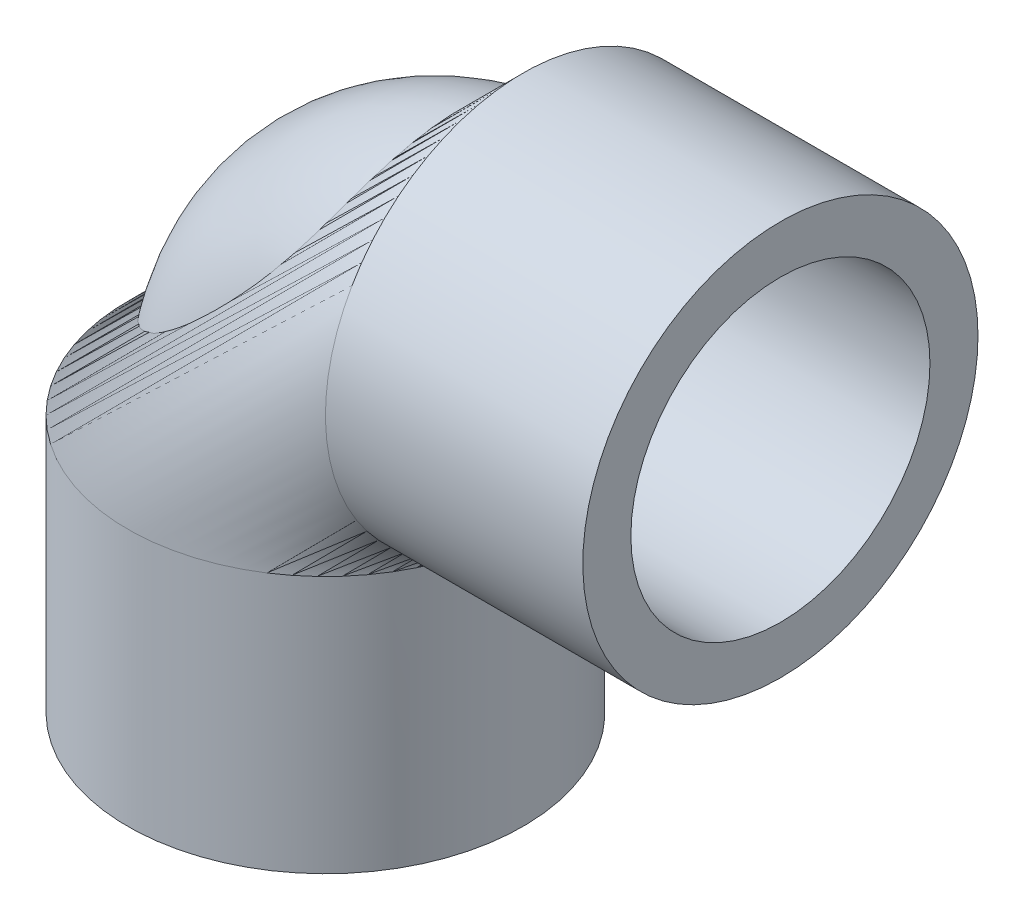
from build123d import *

# Parameters (mm, degrees)
SKETCH8_R          = 13.843
SKETCH8_R_2        = 9.8425
SKETCH9_R          = 10.4775
CUT_EXTRUDE2_DEPTH = 19.05
SKETCH59_R         = 10.4775
CUT_EXTRUDE3_DEPTH = 19.05


with BuildPart() as part:
    # Sweep2: sweep along a path in Sketch1
    with BuildLine(Plane.XY) as sweep2_path:
        Line((18.034, 13.843), (0, 13.843))
        ThreePointArc((0, 13.843), (-9.788479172, 9.788479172), (-13.843, 0))
        Line((-13.843, 0), (-13.843, -18.034))
    # Sketch8 → Sweep2 (sweep)
    with BuildSketch(Plane(origin=(0, 0, 0), x_dir=(0, 0, -1), z_dir=(1, 0, 0))):
        with Locations((0, 13.843)):
            Circle(SKETCH8_R)
        with Locations((0, 13.843)):
            Circle(SKETCH8_R_2, mode=Mode.SUBTRACT)
    sweep(path=sweep2_path.line)

    # Sketch9 → Cut-Extrude2 (cut)
    with BuildSketch(Plane(origin=(18.034, 0, 0), x_dir=(0, 0, -1), z_dir=(1, 0, 0))):
        with Locations((0, 13.843)):
            Circle(SKETCH9_R)
    extrude(amount=-CUT_EXTRUDE2_DEPTH, mode=Mode.SUBTRACT)

    # Sketch59 → Cut-Extrude3 (cut)
    with BuildSketch(Plane.XZ.offset(18.034)):
        with Locations(Location((-13.843, 0, 0), (0, 0, 270))):
            Circle(SKETCH59_R)
    extrude(amount=-CUT_EXTRUDE3_DEPTH, mode=Mode.SUBTRACT)


solid = part.part
